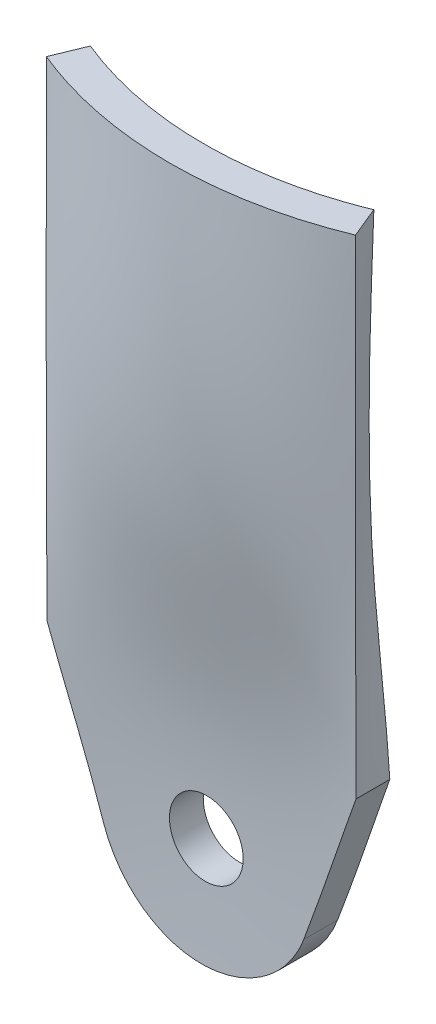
ISO-10303-21;
HEADER;
FILE_DESCRIPTION(('STEP AP214'),'2;1');
FILE_NAME('part.step','',(''),(''),'','','');
FILE_SCHEMA(('AUTOMOTIVE_DESIGN { 1 0 10303 214 1 1 1 1 }'));
ENDSEC;
DATA;
#1=APPLICATION_CONTEXT('core data for automotive mechanical design processes');
#2=APPLICATION_PROTOCOL_DEFINITION('international standard','automotive_design',2000,#1);
#3=PRODUCT_CONTEXT('',#1,'mechanical');
#4=PRODUCT('Part','Part','',(#3));
#5=PRODUCT_RELATED_PRODUCT_CATEGORY('part','',(#4));
#6=PRODUCT_DEFINITION_FORMATION('','',#4);
#7=PRODUCT_DEFINITION_CONTEXT('part definition',#1,'design');
#8=PRODUCT_DEFINITION('design','',#6,#7);
#9=PRODUCT_DEFINITION_SHAPE('','',#8);
#10=(LENGTH_UNIT() NAMED_UNIT(*) SI_UNIT(.MILLI.,.METRE.));
#11=(NAMED_UNIT(*) PLANE_ANGLE_UNIT() SI_UNIT($,.RADIAN.));
#12=(NAMED_UNIT(*) SI_UNIT($,.STERADIAN.) SOLID_ANGLE_UNIT());
#13=UNCERTAINTY_MEASURE_WITH_UNIT(LENGTH_MEASURE(1.E-05),#10,'distance_accuracy_value','');
#14=(GEOMETRIC_REPRESENTATION_CONTEXT(3) GLOBAL_UNCERTAINTY_ASSIGNED_CONTEXT((#13)) GLOBAL_UNIT_ASSIGNED_CONTEXT((#10,
#11,#12)) REPRESENTATION_CONTEXT('',''));
#15=CARTESIAN_POINT('',(0.,0.,0.));
#16=DIRECTION('',(0.,0.,1.));
#17=DIRECTION('',(1.,0.,0.));
#18=AXIS2_PLACEMENT_3D('',#15,#16,#17);
#19=CARTESIAN_POINT('',(27.6985551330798,57.15,6.14951913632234));
#20=CARTESIAN_POINT('',(27.6985551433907,38.0599496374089,6.17635597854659));
#21=CARTESIAN_POINT('',(27.6985551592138,8.76415420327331,6.2175400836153));
#22=CARTESIAN_POINT('',(27.6985550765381,-33.2999360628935,6.00235334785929));
#23=CARTESIAN_POINT('',(27.6985550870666,-56.6760590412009,6.0297565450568));
#24=CARTESIAN_POINT('',(27.698555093,-69.85,6.0452));
#25=CARTESIAN_POINT('',(9.95387424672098,57.15,13.4444482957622));
#26=CARTESIAN_POINT('',(10.1393624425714,38.0599496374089,15.3479577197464));
#27=CARTESIAN_POINT('',(10.4240146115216,8.76415420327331,18.2691036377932));
#28=CARTESIAN_POINT('',(8.93670850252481,-33.2999360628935,3.00613134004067));
#29=CARTESIAN_POINT('',(9.12611117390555,-56.6760590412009,4.94981173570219));
#30=CARTESIAN_POINT('',(9.23285169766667,-69.85,6.0452));
#31=CARTESIAN_POINT('',(-9.95387424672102,57.15,13.4444482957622));
#32=CARTESIAN_POINT('',(-10.1393624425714,38.0599496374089,15.3479577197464));
#33=CARTESIAN_POINT('',(-10.4240146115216,8.76415420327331,18.2691036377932));
#34=CARTESIAN_POINT('',(-8.93670850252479,-33.2999360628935,3.00613134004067));
#35=CARTESIAN_POINT('',(-9.12611117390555,-56.6760590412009,4.94981173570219));
#36=CARTESIAN_POINT('',(-9.23285169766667,-69.85,6.0452));
#37=CARTESIAN_POINT('',(-27.6985551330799,57.15,6.14951913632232));
#38=CARTESIAN_POINT('',(-27.6985551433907,38.0599496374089,6.17635597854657));
#39=CARTESIAN_POINT('',(-27.6985551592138,8.76415420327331,6.21754008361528));
#40=CARTESIAN_POINT('',(-27.6985550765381,-33.2999360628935,6.0023533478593));
#41=CARTESIAN_POINT('',(-27.6985550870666,-56.6760590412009,6.0297565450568));
#42=CARTESIAN_POINT('',(-27.698555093,-69.85,6.0452));
#43=B_SPLINE_SURFACE_WITH_KNOTS('',3,3,((#19,#20,#21,#22,#23,#24),(#25,#26,#27,#28,#29,#30),
(#31,#32,#33,#34,#35,#36),(#37,#38,#39,#40,#41,#42)),.UNSPECIFIED.,.F.,.F.,.F.,(4,4),(4,1,1,4),
(0.,1.),(0.,0.449449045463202,0.689729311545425,1.),.UNSPECIFIED.);
#44=CARTESIAN_POINT('',(-6.604,-50.8,5.18022822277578));
#45=CARTESIAN_POINT('',(-6.60400134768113,-50.6144778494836,5.17690730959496));
#46=CARTESIAN_POINT('',(-6.59617916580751,-50.4289759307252,5.17368909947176));
#47=CARTESIAN_POINT('',(-6.56494411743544,-50.0592246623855,5.16748264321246));
#48=CARTESIAN_POINT('',(-6.54152716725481,-49.8749756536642,5.1644944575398));
#49=CARTESIAN_POINT('',(-6.47923456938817,-49.5089404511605,5.15876929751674));
#50=CARTESIAN_POINT('',(-6.44034522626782,-49.3271565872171,5.15603254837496));
#51=CARTESIAN_POINT('',(-6.34736719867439,-48.9674425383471,5.15083020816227));
#52=CARTESIAN_POINT('',(-6.29327296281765,-48.7895137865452,5.14836471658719));
#53=CARTESIAN_POINT('',(-6.17032669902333,-48.4389936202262,5.14372067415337));
#54=CARTESIAN_POINT('',(-6.10148702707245,-48.2663978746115,5.14154188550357));
#55=CARTESIAN_POINT('',(-5.94948384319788,-47.9275531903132,5.13747465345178));
#56=CARTESIAN_POINT('',(-5.86631505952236,-47.7613066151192,5.13558631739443));
#57=CARTESIAN_POINT('',(-5.6863179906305,-47.4365114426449,5.13210191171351));
#58=CARTESIAN_POINT('',(-5.58949816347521,-47.2779581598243,5.13050566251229));
#59=CARTESIAN_POINT('',(-5.38280977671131,-46.9695101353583,5.12759619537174));
#60=CARTESIAN_POINT('',(-5.27293641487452,-46.8196186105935,5.12628308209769));
#61=CARTESIAN_POINT('',(-5.04099694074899,-46.5296818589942,5.1239265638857));
#62=CARTESIAN_POINT('',(-4.91893569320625,-46.3896327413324,5.12288305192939));
#63=CARTESIAN_POINT('',(-4.66340405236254,-46.1202611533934,5.1210432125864));
#64=CARTESIAN_POINT('',(-4.52992946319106,-45.9909426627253,5.12024697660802));
#65=CARTESIAN_POINT('',(-4.25260502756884,-45.7440509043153,5.11887468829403));
#66=CARTESIAN_POINT('',(-4.10875861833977,-45.6264737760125,5.11829856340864));
#67=CARTESIAN_POINT('',(-3.81161897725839,-45.4038108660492,5.11733324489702));
#68=CARTESIAN_POINT('',(-3.65832227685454,-45.2987297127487,5.1169441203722));
#69=CARTESIAN_POINT('',(-3.34348273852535,-45.1018957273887,5.11631721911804));
#70=CARTESIAN_POINT('',(-3.18194319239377,-45.0101376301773,5.11607938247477));
#71=CARTESIAN_POINT('',(-2.85164925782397,-44.8405208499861,5.11571754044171));
#72=CARTESIAN_POINT('',(-2.68289222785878,-44.7626673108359,5.11559357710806));
#73=CARTESIAN_POINT('',(-2.33948172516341,-44.6214813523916,5.11542346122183));
#74=CARTESIAN_POINT('',(-2.16483046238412,-44.5581435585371,5.11537727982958));
#75=CARTESIAN_POINT('',(-1.81075234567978,-44.4463808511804,5.11532990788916));
#76=CARTESIAN_POINT('',(-1.63132375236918,-44.3979614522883,5.11532873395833));
#77=CARTESIAN_POINT('',(-1.26906579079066,-44.3164262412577,5.11534406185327));
#78=CARTESIAN_POINT('',(-1.08623745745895,-44.2833058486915,5.11536055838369));
#79=CARTESIAN_POINT('',(-0.718424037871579,-44.2325640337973,5.11539208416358));
#80=CARTESIAN_POINT('',(-0.533438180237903,-44.2149483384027,5.11540711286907));
#81=CARTESIAN_POINT('',(0.0226468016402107,-44.185641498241,5.11543048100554));
#82=CARTESIAN_POINT('',(0.395267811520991,-44.1974021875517,5.1154171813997));
#83=CARTESIAN_POINT('',(1.13304842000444,-44.2833175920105,5.11535847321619));
#84=CARTESIAN_POINT('',(1.49820791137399,-44.3574732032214,5.11531306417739));
#85=CARTESIAN_POINT('',(2.21094937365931,-44.56603610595,5.11536665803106));
#86=CARTESIAN_POINT('',(2.55853132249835,-44.7004434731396,5.1154656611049));
#87=CARTESIAN_POINT('',(3.22618100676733,-45.0257042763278,5.11608086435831));
#88=CARTESIAN_POINT('',(3.54624881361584,-45.2165575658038,5.11659706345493));
#89=CARTESIAN_POINT('',(4.14980257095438,-45.6492886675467,5.11834608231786));
#90=CARTESIAN_POINT('',(4.43328855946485,-45.8911664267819,5.11957890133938));
#91=CARTESIAN_POINT('',(4.95561220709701,-46.419064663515,5.1230156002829));
#92=CARTESIAN_POINT('',(5.19445216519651,-46.7050828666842,5.12521943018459));
#93=CARTESIAN_POINT('',(5.6207239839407,-47.3131476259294,5.13075731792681));
#94=CARTESIAN_POINT('',(5.80815585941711,-47.6351941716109,5.13409137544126));
#95=CARTESIAN_POINT('',(6.12628702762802,-48.3061543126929,5.14193292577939));
#96=CARTESIAN_POINT('',(6.25698883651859,-48.6550667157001,5.14644036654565));
#97=CARTESIAN_POINT('',(6.45796890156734,-49.3698649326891,5.15656282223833));
#98=CARTESIAN_POINT('',(6.52824712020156,-49.7357507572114,5.16217783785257));
#99=CARTESIAN_POINT('',(6.60639831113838,-50.4741580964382,5.17436215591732));
#100=CARTESIAN_POINT('',(6.61426344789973,-50.8466804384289,5.18093157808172));
#101=CARTESIAN_POINT('',(6.56735240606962,-51.5877459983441,5.19480387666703));
#102=CARTESIAN_POINT('',(6.51257614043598,-51.9562892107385,5.20210675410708));
#103=CARTESIAN_POINT('',(6.34192100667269,-52.6790307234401,5.21717507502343));
#104=CARTESIAN_POINT('',(6.22602736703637,-53.0332255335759,5.22494062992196));
#105=CARTESIAN_POINT('',(5.93642012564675,-53.7171273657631,5.24061236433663));
#106=CARTESIAN_POINT('',(5.76270645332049,-54.046834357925,5.24851854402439));
#107=CARTESIAN_POINT('',(5.36235272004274,-54.6724579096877,5.26410767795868));
#108=CARTESIAN_POINT('',(5.13570405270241,-54.9683689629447,5.27179059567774));
#109=CARTESIAN_POINT('',(4.63592895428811,-55.5179380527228,5.28653114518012));
#110=CARTESIAN_POINT('',(4.36280250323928,-55.7715960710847,5.29358877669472));
#111=CARTESIAN_POINT('',(3.77782659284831,-56.2294337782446,5.30666465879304));
#112=CARTESIAN_POINT('',(3.46598054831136,-56.4336178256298,5.31268300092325));
#113=CARTESIAN_POINT('',(2.8124650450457,-56.7867257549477,5.32329153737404));
#114=CARTESIAN_POINT('',(2.47079568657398,-56.935649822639,5.32788173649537));
#115=CARTESIAN_POINT('',(1.76721249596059,-57.1739685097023,5.33531152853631));
#116=CARTESIAN_POINT('',(1.40530641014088,-57.2633857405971,5.33815178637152));
#117=CARTESIAN_POINT('',(0.855406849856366,-57.3510104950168,5.340946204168));
#118=CARTESIAN_POINT('',(0.670832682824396,-57.3724675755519,5.3416333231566));
#119=CARTESIAN_POINT('',(0.300550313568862,-57.3997637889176,5.3425081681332));
#120=CARTESIAN_POINT('',(0.114842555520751,-57.4056086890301,5.34269607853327));
#121=CARTESIAN_POINT('',(-0.256386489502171,-57.4016328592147,5.34256848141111));
#122=CARTESIAN_POINT('',(-0.441907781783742,-57.3918125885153,5.34225298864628));
#123=CARTESIAN_POINT('',(-0.811397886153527,-57.3565899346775,5.34112505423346));
#124=CARTESIAN_POINT('',(-0.99536724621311,-57.3311933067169,5.34031279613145));
#125=CARTESIAN_POINT('',(-1.36057886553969,-57.264990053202,5.33820625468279));
#126=CARTESIAN_POINT('',(-1.54182008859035,-57.2241777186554,5.33691179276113));
#127=CARTESIAN_POINT('',(-1.90015193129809,-57.1274532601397,5.33386540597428));
#128=CARTESIAN_POINT('',(-2.07724405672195,-57.0715467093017,5.33211364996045));
#129=CARTESIAN_POINT('',(-2.42615622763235,-56.9450007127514,5.32818340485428));
#130=CARTESIAN_POINT('',(-2.59797421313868,-56.8743555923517,5.32600475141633));
#131=CARTESIAN_POINT('',(-2.93498369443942,-56.7188775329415,5.32126043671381));
#132=CARTESIAN_POINT('',(-3.10017760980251,-56.6340498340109,5.31869491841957));
#133=CARTESIAN_POINT('',(-3.42288723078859,-56.4507614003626,5.31321908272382));
#134=CARTESIAN_POINT('',(-3.5804003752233,-56.3522961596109,5.31030865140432));
#135=CARTESIAN_POINT('',(-3.88651519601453,-56.1424932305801,5.30419247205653));
#136=CARTESIAN_POINT('',(-4.03512013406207,-56.0311602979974,5.30098683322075));
#137=CARTESIAN_POINT('',(-4.32252254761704,-55.7963062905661,5.29432725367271));
#138=CARTESIAN_POINT('',(-4.46131350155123,-55.6727772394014,5.29087315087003));
#139=CARTESIAN_POINT('',(-4.72794576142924,-55.4145183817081,5.28377120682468));
#140=CARTESIAN_POINT('',(-4.85579108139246,-55.2797927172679,5.28012343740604));
#141=CARTESIAN_POINT('',(-5.0997581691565,-54.999971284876,5.27268198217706));
#142=CARTESIAN_POINT('',(-5.21587263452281,-54.854869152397,5.26888820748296));
#143=CARTESIAN_POINT('',(-5.43542278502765,-54.5554554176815,5.26120865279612));
#144=CARTESIAN_POINT('',(-5.53886312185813,-54.4011472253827,5.25732290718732));
#145=CARTESIAN_POINT('',(-5.73249950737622,-54.0841740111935,5.24950178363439));
#146=CARTESIAN_POINT('',(-5.82267916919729,-53.9214989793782,5.24556635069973));
#147=CARTESIAN_POINT('',(-5.9889704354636,-53.5891860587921,5.23769836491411));
#148=CARTESIAN_POINT('',(-6.06508716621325,-53.4195507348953,5.23376581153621));
#149=CARTESIAN_POINT('',(-6.20269110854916,-53.0746172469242,5.22594920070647));
#150=CARTESIAN_POINT('',(-6.26419124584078,-52.8993242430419,5.22206510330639));
#151=CARTESIAN_POINT('',(-6.37219627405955,-52.5442384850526,5.21438384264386));
#152=CARTESIAN_POINT('',(-6.41870509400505,-52.3644469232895,5.21058665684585));
#153=CARTESIAN_POINT('',(-6.50618800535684,-51.9559514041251,5.20217632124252));
#154=CARTESIAN_POINT('',(-6.5428358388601,-51.726307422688,5.19759785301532));
#155=CARTESIAN_POINT('',(-6.59174099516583,-51.2644317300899,5.18870203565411));
#156=CARTESIAN_POINT('',(-6.6039983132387,-51.0322000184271,5.18438468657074));
#157=CARTESIAN_POINT('',(-6.604,-50.8,5.18022822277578));
#158=B_SPLINE_CURVE_WITH_KNOTS('',3,(#44,#45,#46,#47,#48,#49,#50,#51,#52,#53,#54,#55,#56,#57,
#58,#59,#60,#61,#62,#63,#64,#65,#66,#67,#68,#69,#70,#71,#72,#73,#74,#75,#76,#77,#78,#79,#80,#81,
#82,#83,#84,#85,#86,#87,#88,#89,#90,#91,#92,#93,#94,#95,#96,#97,#98,#99,#100,#101,#102,#103,
#104,#105,#106,#107,#108,#109,#110,#111,#112,#113,#114,#115,#116,#117,#118,#119,#120,#121,#122,
#123,#124,#125,#126,#127,#128,#129,#130,#131,#132,#133,#134,#135,#136,#137,#138,#139,#140,#141,
#142,#143,#144,#145,#146,#147,#148,#149,#150,#151,#152,#153,#154,#155,#156,#157),.UNSPECIFIED.,
.T.,.F.,(4,2,2,2,2,2,2,2,2,2,2,2,2,2,2,2,2,2,2,2,2,2,2,2,2,2,2,2,2,2,2,2,2,2,2,2,2,2,2,2,2,2,2,
2,2,2,2,2,2,2,2,2,2,2,2,2,4),(0.,0.556452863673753,1.11305149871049,1.67014390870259,
2.22743998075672,2.78427087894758,3.34130707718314,3.89799964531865,4.45489765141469,
5.01157425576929,5.56845639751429,6.12515482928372,6.68205881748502,7.23874211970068,
7.7956309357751,8.35231322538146,8.90920104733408,9.46592203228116,10.0228485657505,
11.1355041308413,12.2481756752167,13.360848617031,14.4735186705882,15.5861875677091,
16.6987991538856,17.8114104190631,18.9239723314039,20.0365349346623,21.1492372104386,
22.2619410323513,23.3749139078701,24.4878881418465,25.6010434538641,26.7141992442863,
27.8272569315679,28.9403108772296,30.0529416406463,30.6098548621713,31.1665623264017,
31.7232534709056,32.2797390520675,32.836430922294,33.3929175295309,33.9496187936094,
34.5061148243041,35.0627951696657,35.6192704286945,36.1761120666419,36.7327486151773,
37.2897295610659,37.8465054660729,38.4039637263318,38.961218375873,39.5179783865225,
40.0745923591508,40.7710501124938,41.4675080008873),.UNSPECIFIED.);
#159=CARTESIAN_POINT('',(-6.604,-50.8,5.18022822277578));
#160=VERTEX_POINT('',#159);
#161=EDGE_CURVE('E485',#160,#160,#158,.T.);
#162=CARTESIAN_POINT('',(-27.6985551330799,57.15,6.14951913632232));
#163=CARTESIAN_POINT('',(-27.6985551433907,38.0599496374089,6.17635597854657));
#164=CARTESIAN_POINT('',(-27.6985551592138,8.76415420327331,6.21754008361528));
#165=CARTESIAN_POINT('',(-27.6985550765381,-33.2999360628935,6.0023533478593));
#166=CARTESIAN_POINT('',(-27.6985550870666,-56.6760590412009,6.0297565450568));
#167=CARTESIAN_POINT('',(-27.698555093,-69.85,6.0452));
#168=B_SPLINE_CURVE_WITH_KNOTS('',3,(#162,#163,#164,#165,#166,#167),.UNSPECIFIED.,.F.,.F.,(4,1,
1,4),(0.,0.449449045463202,0.689729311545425,1.),.UNSPECIFIED.);
#169=CARTESIAN_POINT('',(-27.6985551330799,57.15,6.14951913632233));
#170=VERTEX_POINT('',#169);
#171=CARTESIAN_POINT('',(-27.698555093,-30.397318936,6.0452));
#172=VERTEX_POINT('',#171);
#173=EDGE_CURVE('E484',#170,#172,#168,.T.);
#174=CARTESIAN_POINT('',(-27.6985550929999,-30.3973190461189,6.04519999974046));
#175=CARTESIAN_POINT('',(-27.535221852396,-30.8460734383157,6.04413267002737));
#176=CARTESIAN_POINT('',(-27.3718917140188,-31.2948193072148,6.04117638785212));
#177=CARTESIAN_POINT('',(-27.0452442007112,-32.1922759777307,6.03213643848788));
#178=CARTESIAN_POINT('',(-26.8819268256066,-32.6409867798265,6.02605282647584));
#179=CARTESIAN_POINT('',(-26.555320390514,-33.5383305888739,6.01140931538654));
#180=CARTESIAN_POINT('',(-26.392031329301,-33.9869635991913,6.00284964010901));
#181=CARTESIAN_POINT('',(-26.0654655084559,-34.8841958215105,5.98383468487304));
#182=CARTESIAN_POINT('',(-25.9021887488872,-35.332795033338,5.97337939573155));
#183=CARTESIAN_POINT('',(-25.4123807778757,-36.6785313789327,5.93999227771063));
#184=CARTESIAN_POINT('',(-25.0858660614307,-37.575623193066,5.91503889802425));
#185=CARTESIAN_POINT('',(-24.4328561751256,-39.3697531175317,5.86351087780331));
#186=CARTESIAN_POINT('',(-24.1063610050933,-40.2667912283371,5.83693625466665));
#187=CARTESIAN_POINT('',(-23.4533653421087,-42.0608820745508,5.78523896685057));
#188=CARTESIAN_POINT('',(-23.1268648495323,-42.9579348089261,5.76011626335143));
#189=CARTESIAN_POINT('',(-22.4737998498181,-44.7522161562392,5.71378544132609));
#190=CARTESIAN_POINT('',(-22.1472353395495,-45.6494447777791,5.69257768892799));
#191=CARTESIAN_POINT('',(-21.494082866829,-47.4439664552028,5.65597676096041));
#192=CARTESIAN_POINT('',(-21.1674949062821,-48.3412595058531,5.64058330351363));
#193=CARTESIAN_POINT('',(-20.5142926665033,-50.1359179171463,5.61697511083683));
#194=CARTESIAN_POINT('',(-20.1876783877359,-51.0332832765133,5.60876026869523));
#195=CARTESIAN_POINT('',(-19.5344214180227,-52.8280920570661,5.60038058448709));
#196=CARTESIAN_POINT('',(-19.2077787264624,-53.7255354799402,5.60021611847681));
#197=CARTESIAN_POINT('',(-18.7178046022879,-55.0717283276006,5.60630702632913));
#198=CARTESIAN_POINT('',(-18.5544679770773,-55.5204920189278,5.60939398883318));
#199=CARTESIAN_POINT('',(-18.2278008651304,-56.418002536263,5.61768185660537));
#200=CARTESIAN_POINT('',(-18.0644703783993,-56.8667493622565,5.62288276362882));
#201=CARTESIAN_POINT('',(-17.9011444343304,-57.3154837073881,5.62914112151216));
#202=B_SPLINE_CURVE_WITH_KNOTS('',3,(#174,#175,#176,#177,#178,#179,#180,#181,#182,#183,#184,
#185,#186,#187,#188,#189,#190,#191,#192,#193,#194,#195,#196,#197,#198,#199,#200,#201),
.UNSPECIFIED.,.F.,.F.,(4,2,2,2,2,2,2,2,2,2,2,2,2,4),(0.,1.43265623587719,2.86528719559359,
4.29778870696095,5.73029715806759,8.59526306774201,11.4601982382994,14.325056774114,
17.1901830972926,20.0551705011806,22.9201152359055,25.7851938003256,27.2179126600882,
28.6506327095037),.UNSPECIFIED.);
#203=CARTESIAN_POINT('',(-17.9011444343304,-57.3154837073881,5.62914112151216));
#204=VERTEX_POINT('',#203);
#205=EDGE_CURVE('E421',#172,#204,#202,.T.);
#206=CARTESIAN_POINT('',(-17.9011444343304,-57.3154837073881,5.62914112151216));
#207=CARTESIAN_POINT('',(-17.7789793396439,-57.65116290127,5.63381747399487));
#208=CARTESIAN_POINT('',(-17.6473528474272,-57.9833943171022,5.63869282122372));
#209=CARTESIAN_POINT('',(-17.3656478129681,-58.6399137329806,5.64889722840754));
#210=CARTESIAN_POINT('',(-17.2155701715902,-58.9642021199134,5.65422626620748));
#211=CARTESIAN_POINT('',(-16.8974242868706,-59.6038151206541,5.66539412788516));
#212=CARTESIAN_POINT('',(-16.7293563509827,-59.9191398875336,5.6712329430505));
#213=CARTESIAN_POINT('',(-16.3758949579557,-60.5396070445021,5.68344699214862));
#214=CARTESIAN_POINT('',(-16.1905142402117,-60.8447567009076,5.68982183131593));
#215=CARTESIAN_POINT('',(-15.8029076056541,-61.4441523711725,5.70311954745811));
#216=CARTESIAN_POINT('',(-15.6006818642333,-61.7383984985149,5.71004241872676));
#217=CARTESIAN_POINT('',(-15.1800422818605,-62.3150426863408,5.72441587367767));
#218=CARTESIAN_POINT('',(-14.9616285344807,-62.5974408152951,5.73186645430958));
#219=CARTESIAN_POINT('',(-14.3960641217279,-63.287692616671,5.75110203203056));
#220=CARTESIAN_POINT('',(-14.0391794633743,-63.6876202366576,5.76319051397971));
#221=CARTESIAN_POINT('',(-13.2929325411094,-64.4560353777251,5.78819260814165));
#222=CARTESIAN_POINT('',(-12.9035659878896,-64.8245187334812,5.80110632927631));
#223=CARTESIAN_POINT('',(-12.2974029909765,-65.3515679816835,5.82079751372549));
#224=CARTESIAN_POINT('',(-12.0916502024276,-65.5229812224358,5.82741507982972));
#225=CARTESIAN_POINT('',(-11.6731653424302,-65.856937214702,5.84069807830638));
#226=CARTESIAN_POINT('',(-11.4604352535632,-66.019482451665,5.84736349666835));
#227=CARTESIAN_POINT('',(-10.8122044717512,-66.493476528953,5.8673448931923));
#228=CARTESIAN_POINT('',(-10.3666286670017,-66.7913138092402,5.88064715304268));
#229=CARTESIAN_POINT('',(-9.45182459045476,-67.3484912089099,5.90668683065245));
#230=CARTESIAN_POINT('',(-8.98258621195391,-67.6078146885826,5.91942400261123));
#231=CARTESIAN_POINT('',(-8.02388812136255,-68.0860239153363,5.94378880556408));
#232=CARTESIAN_POINT('',(-7.53442836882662,-68.3049095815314,5.95541643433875));
#233=CARTESIAN_POINT('',(-6.53870834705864,-68.7006948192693,5.97704875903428));
#234=CARTESIAN_POINT('',(-6.03244573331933,-68.8775885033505,5.98705322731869));
#235=CARTESIAN_POINT('',(-5.00677822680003,-69.1880876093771,6.00498310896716));
#236=CARTESIAN_POINT('',(-4.48737335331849,-69.3216930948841,6.01290852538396));
#237=CARTESIAN_POINT('',(-3.43951311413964,-69.5445714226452,6.02630991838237));
#238=CARTESIAN_POINT('',(-2.91106481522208,-69.6338773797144,6.03178772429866));
#239=CARTESIAN_POINT('',(-1.84850286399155,-69.767663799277,6.04004831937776));
#240=CARTESIAN_POINT('',(-1.31438921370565,-69.8121442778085,6.04283110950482));
#241=CARTESIAN_POINT('',(-0.244340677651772,-69.855957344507,6.04557187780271));
#242=CARTESIAN_POINT('',(0.291594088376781,-69.8552928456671,6.04553003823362));
#243=CARTESIAN_POINT('',(1.36149526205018,-69.8088279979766,6.0426239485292));
#244=CARTESIAN_POINT('',(1.89546167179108,-69.7630276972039,6.03975970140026));
#245=CARTESIAN_POINT('',(2.95678369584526,-69.6267290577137,6.03134891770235));
#246=CARTESIAN_POINT('',(3.4841483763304,-69.5363010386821,6.02580660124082));
#247=CARTESIAN_POINT('',(4.52937601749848,-69.3114294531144,6.0122979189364));
#248=CARTESIAN_POINT('',(5.04723898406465,-69.1769859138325,6.0043315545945));
#249=CARTESIAN_POINT('',(6.06977613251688,-68.8650499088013,5.98634046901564));
#250=CARTESIAN_POINT('',(6.57445077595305,-68.687558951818,5.97631581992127));
#251=CARTESIAN_POINT('',(7.56705984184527,-68.2907914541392,5.95466079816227));
#252=CARTESIAN_POINT('',(8.05499427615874,-68.0715149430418,5.94303042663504));
#253=CARTESIAN_POINT('',(9.01108982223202,-67.5925243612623,5.91866531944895));
#254=CARTESIAN_POINT('',(9.47923378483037,-67.3327760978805,5.90592965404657));
#255=CARTESIAN_POINT('',(10.391987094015,-66.7748319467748,5.87990091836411));
#256=CARTESIAN_POINT('',(10.8365962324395,-66.4766357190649,5.86660784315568));
#257=CARTESIAN_POINT('',(11.6993689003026,-65.8437203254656,5.83998281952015));
#258=CARTESIAN_POINT('',(12.1175219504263,-65.5089868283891,5.82665085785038));
#259=CARTESIAN_POINT('',(12.7223863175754,-64.981502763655,5.80698657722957));
#260=CARTESIAN_POINT('',(12.9202857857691,-64.8014383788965,5.80048723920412));
#261=CARTESIAN_POINT('',(13.3083824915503,-64.4330864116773,5.78764625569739));
#262=CARTESIAN_POINT('',(13.4985777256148,-64.2447967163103,5.78130465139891));
#263=CARTESIAN_POINT('',(14.0577110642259,-63.6674240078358,5.76256538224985));
#264=CARTESIAN_POINT('',(14.41450256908,-63.2664428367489,5.75047607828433));
#265=CARTESIAN_POINT('',(15.0929923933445,-62.4357923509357,5.72739740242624));
#266=CARTESIAN_POINT('',(15.4146910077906,-62.0061232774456,5.71640802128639));
#267=CARTESIAN_POINT('',(15.8689425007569,-61.3428130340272,5.70085407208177));
#268=CARTESIAN_POINT('',(16.0155659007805,-61.1187120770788,5.69582711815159));
#269=CARTESIAN_POINT('',(16.2992062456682,-60.6645855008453,5.68608175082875));
#270=CARTESIAN_POINT('',(16.4362253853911,-60.434561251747,5.68136326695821));
#271=CARTESIAN_POINT('',(16.83244308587,-59.7363029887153,5.66766843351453));
#272=CARTESIAN_POINT('',(17.0769995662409,-59.2595947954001,5.65914596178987));
#273=CARTESIAN_POINT('',(17.4110830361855,-58.5347249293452,5.64725134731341));
#274=CARTESIAN_POINT('',(17.5162082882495,-58.2936073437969,5.64346388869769));
#275=CARTESIAN_POINT('',(17.716243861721,-57.8075759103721,5.6361316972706));
#276=CARTESIAN_POINT('',(17.8111687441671,-57.5626680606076,5.63258662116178));
#277=CARTESIAN_POINT('',(17.901007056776,-57.3158611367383,5.62914638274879));
#278=B_SPLINE_CURVE_WITH_KNOTS('',3,(#206,#207,#208,#209,#210,#211,#212,#213,#214,#215,#216,
#217,#218,#219,#220,#221,#222,#223,#224,#225,#226,#227,#228,#229,#230,#231,#232,#233,#234,#235,
#236,#237,#238,#239,#240,#241,#242,#243,#244,#245,#246,#247,#248,#249,#250,#251,#252,#253,#254,
#255,#256,#257,#258,#259,#260,#261,#262,#263,#264,#265,#266,#267,#268,#269,#270,#271,#272,#273,
#274,#275,#276,#277),.UNSPECIFIED.,.F.,.F.,(4,2,2,2,2,2,2,2,2,2,2,2,2,2,2,2,2,2,2,2,2,2,2,2,2,2,
2,2,2,2,2,2,2,2,2,4),(0.,1.07160285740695,2.14315341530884,3.21468566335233,4.28543555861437,
5.35617430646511,6.42690686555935,8.03337587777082,9.64005736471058,10.4434939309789,
11.2467041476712,12.852987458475,14.4599627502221,16.0669412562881,17.6741449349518,
19.281346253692,20.8873443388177,22.4933418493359,24.0992357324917,25.70512790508,
27.3084977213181,28.9118665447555,30.515179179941,32.1184906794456,33.7231641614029,
35.3278518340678,36.93317119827,37.7358785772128,38.538793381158,40.1473783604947,
41.7559498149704,42.5592940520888,43.3624540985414,44.9677276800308,45.7567416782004,
46.5446139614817),.UNSPECIFIED.);
#279=CARTESIAN_POINT('',(17.901007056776,-57.3158611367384,5.62914638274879));
#280=VERTEX_POINT('',#279);
#281=EDGE_CURVE('E605',#204,#280,#278,.T.);
#282=CARTESIAN_POINT('',(17.901007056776,-57.3158611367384,5.62914638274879));
#283=CARTESIAN_POINT('',(18.0643352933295,-56.8671499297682,5.62288810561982));
#284=CARTESIAN_POINT('',(18.2276680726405,-56.4184262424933,5.61768720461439));
#285=CARTESIAN_POINT('',(18.554339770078,-55.5209620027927,5.60939920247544));
#286=CARTESIAN_POINT('',(18.7176786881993,-55.0722214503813,5.6063120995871));
#287=CARTESIAN_POINT('',(19.207659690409,-53.7260980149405,5.60022055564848));
#288=CARTESIAN_POINT('',(19.5343069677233,-52.8287008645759,5.6003843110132));
#289=CARTESIAN_POINT('',(20.1875731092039,-51.0339846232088,5.60876207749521));
#290=CARTESIAN_POINT('',(20.5141919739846,-50.1366655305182,5.61697571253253));
#291=CARTESIAN_POINT('',(21.1674033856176,-48.3420996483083,5.6405811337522));
#292=CARTESIAN_POINT('',(21.4939959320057,-47.4448528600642,5.65597302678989));
#293=CARTESIAN_POINT('',(22.1471575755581,-45.6504237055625,5.69257067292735));
#294=CARTESIAN_POINT('',(22.4737266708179,-44.7532413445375,5.71377670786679));
#295=CARTESIAN_POINT('',(23.1268008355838,-42.959052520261,5.76010421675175));
#296=CARTESIAN_POINT('',(23.4533059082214,-42.0620460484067,5.7852253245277));
#297=CARTESIAN_POINT('',(24.1063107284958,-40.2680477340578,5.83691989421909));
#298=CARTESIAN_POINT('',(24.4328104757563,-39.3710558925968,5.86349339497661));
#299=CARTESIAN_POINT('',(25.0858295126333,-37.5770185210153,5.91502007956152));
#300=CARTESIAN_POINT('',(25.412348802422,-36.6799729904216,5.93997324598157));
#301=CARTESIAN_POINT('',(25.9021636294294,-35.3343060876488,5.97336112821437));
#302=CARTESIAN_POINT('',(26.0654426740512,-34.885730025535,5.98381685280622));
#303=CARTESIAN_POINT('',(26.3920130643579,-33.9885441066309,6.00283311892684));
#304=CARTESIAN_POINT('',(26.5553044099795,-33.5399342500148,6.01139366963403));
#305=CARTESIAN_POINT('',(26.88191541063,-32.6426367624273,6.02603945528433));
#306=CARTESIAN_POINT('',(27.0452350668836,-32.193949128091,6.03212446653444));
#307=CARTESIAN_POINT('',(27.3718871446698,-31.2965387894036,6.04116783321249));
#308=CARTESIAN_POINT('',(27.5352195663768,-30.8478160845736,6.04412613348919));
#309=CARTESIAN_POINT('',(27.6985550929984,-30.3990848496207,6.04519583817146));
#310=B_SPLINE_CURVE_WITH_KNOTS('',3,(#282,#283,#284,#285,#286,#287,#288,#289,#290,#291,#292,
#293,#294,#295,#296,#297,#298,#299,#300,#301,#302,#303,#304,#305,#306,#307,#308,#309),
.UNSPECIFIED.,.F.,.F.,(4,2,2,2,2,2,2,2,2,2,2,2,2,4),(0.,1.43265717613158,2.86531316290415,
5.73026599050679,8.59508497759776,11.4599466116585,14.3249471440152,17.1896798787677,
20.054489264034,22.9193294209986,24.3517750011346,25.7842136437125,27.2167816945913,
28.6493750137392),.UNSPECIFIED.);
#311=CARTESIAN_POINT('',(27.6985550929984,-30.3990848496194,6.04519583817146));
#312=VERTEX_POINT('',#311);
#313=EDGE_CURVE('E603',#280,#312,#310,.T.);
#314=CARTESIAN_POINT('',(27.6985551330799,57.15,6.14951913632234));
#315=CARTESIAN_POINT('',(27.6985551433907,38.0599496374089,6.17635597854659));
#316=CARTESIAN_POINT('',(27.6985551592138,8.76415420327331,6.2175400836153));
#317=CARTESIAN_POINT('',(27.6985550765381,-33.2999360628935,6.00235334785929));
#318=CARTESIAN_POINT('',(27.6985550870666,-56.6760590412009,6.0297565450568));
#319=CARTESIAN_POINT('',(27.698555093,-69.85,6.0452));
#320=B_SPLINE_CURVE_WITH_KNOTS('',3,(#314,#315,#316,#317,#318,#319),.UNSPECIFIED.,.F.,.F.,(4,1,
1,4),(0.,0.449449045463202,0.689729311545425,1.),.UNSPECIFIED.);
#321=CARTESIAN_POINT('',(27.6985551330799,57.15,6.14951913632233));
#322=VERTEX_POINT('',#321);
#323=EDGE_CURVE('E633',#322,#312,#320,.T.);
#324=CARTESIAN_POINT('',(27.6985551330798,57.15,6.14951913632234));
#325=CARTESIAN_POINT('',(9.95387424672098,57.15,13.4444482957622));
#326=CARTESIAN_POINT('',(-9.95387424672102,57.15,13.4444482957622));
#327=CARTESIAN_POINT('',(-27.6985551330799,57.15,6.14951913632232));
#328=B_SPLINE_CURVE_WITH_KNOTS('',3,(#324,#325,#326,#327),.UNSPECIFIED.,.F.,.F.,(4,4),(0.,1.),.UNSPECIFIED.);
#329=EDGE_CURVE('E653',#170,#322,#328,.F.);
#330=ORIENTED_EDGE('',*,*,#161,.T.);
#331=EDGE_LOOP('',(#330));
#332=FACE_BOUND('',#331,.T.);
#333=ORIENTED_EDGE('',*,*,#173,.T.);
#334=ORIENTED_EDGE('',*,*,#205,.T.);
#335=ORIENTED_EDGE('',*,*,#281,.T.);
#336=ORIENTED_EDGE('',*,*,#313,.T.);
#337=ORIENTED_EDGE('',*,*,#323,.F.);
#338=ORIENTED_EDGE('',*,*,#329,.F.);
#339=EDGE_LOOP('',(#333,#334,#335,#336,#337,#338));
#340=FACE_BOUND('',#339,.T.);
#341=ADVANCED_FACE('F403',(#332,#340),#43,.T.);
#342=CARTESIAN_POINT('',(-25.4,57.15,0.558357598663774));
#343=CARTESIAN_POINT('',(-24.8086803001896,38.0599496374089,0.701999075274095));
#344=CARTESIAN_POINT('',(-23.9012347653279,8.76415420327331,0.922432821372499));
#345=CARTESIAN_POINT('',(-28.6426329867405,-33.2999360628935,-0.229332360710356));
#346=CARTESIAN_POINT('',(-28.0388342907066,-56.6760590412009,-0.082659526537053));
#347=CARTESIAN_POINT('',(-27.698555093,-69.85,0.));
#348=CARTESIAN_POINT('',(-9.12785539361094,57.15,7.24791955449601));
#349=CARTESIAN_POINT('',(-9.10084434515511,38.0599496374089,9.11249857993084));
#350=CARTESIAN_POINT('',(-9.05939290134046,8.76415420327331,11.9739014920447));
#351=CARTESIAN_POINT('',(-9.27597648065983,-33.2999360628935,-2.97691390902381));
#352=CARTESIAN_POINT('',(-9.2483954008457,-56.6760590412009,-1.07298548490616));
#353=CARTESIAN_POINT('',(-9.23285169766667,-69.85,0.));
#354=CARTESIAN_POINT('',(9.12785539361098,57.15,7.24791955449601));
#355=CARTESIAN_POINT('',(9.10084434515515,38.0599496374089,9.11249857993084));
#356=CARTESIAN_POINT('',(9.05939290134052,8.76415420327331,11.9739014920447));
#357=CARTESIAN_POINT('',(9.27597648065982,-33.2999360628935,-2.97691390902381));
#358=CARTESIAN_POINT('',(9.24839540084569,-56.6760590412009,-1.07298548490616));
#359=CARTESIAN_POINT('',(9.23285169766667,-69.85,0.));
#360=CARTESIAN_POINT('',(25.4,57.15,0.558357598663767));
#361=CARTESIAN_POINT('',(24.8086803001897,38.0599496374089,0.701999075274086));
#362=CARTESIAN_POINT('',(23.901234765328,8.76415420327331,0.922432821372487));
#363=CARTESIAN_POINT('',(28.6426329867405,-33.2999360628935,-0.229332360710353));
#364=CARTESIAN_POINT('',(28.0388342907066,-56.6760590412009,-0.082659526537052));
#365=CARTESIAN_POINT('',(27.698555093,-69.85,0.));
#366=B_SPLINE_SURFACE_WITH_KNOTS('',3,3,((#342,#343,#344,#345,#346,#347),(#348,#349,#350,#351,
#352,#353),(#354,#355,#356,#357,#358,#359),(#360,#361,#362,#363,#364,#365)),.UNSPECIFIED.,.F.,
.F.,.F.,(4,4),(4,1,1,4),(0.,1.),(0.,0.449449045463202,0.689729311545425,1.),.UNSPECIFIED.);
#367=CARTESIAN_POINT('',(-6.604,-50.8,-0.870528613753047));
#368=CARTESIAN_POINT('',(-6.60400133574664,-50.9855841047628,-0.867180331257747));
#369=CARTESIAN_POINT('',(-6.59617392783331,-51.1711441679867,-0.863715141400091));
#370=CARTESIAN_POINT('',(-6.56491998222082,-51.5410028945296,-0.85658126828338));
#371=CARTESIAN_POINT('',(-6.54148934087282,-51.7253012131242,-0.852912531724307));
#372=CARTESIAN_POINT('',(-6.47916277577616,-52.0914266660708,-0.845405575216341));
#373=CARTESIAN_POINT('',(-6.44025307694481,-52.273251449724,-0.841567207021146));
#374=CARTESIAN_POINT('',(-6.34722955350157,-52.6330383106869,-0.833762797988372));
#375=CARTESIAN_POINT('',(-6.29311017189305,-52.8109989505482,-0.829796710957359));
#376=CARTESIAN_POINT('',(-6.1701113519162,-53.1615716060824,-0.821785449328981));
#377=CARTESIAN_POINT('',(-6.10124452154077,-53.3341880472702,-0.817740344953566));
#378=CARTESIAN_POINT('',(-5.94918512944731,-53.6730671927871,-0.809613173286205));
#379=CARTESIAN_POINT('',(-5.86598729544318,-53.8393275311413,-0.805531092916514));
#380=CARTESIAN_POINT('',(-5.68593066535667,-54.1641446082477,-0.797383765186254));
#381=CARTESIAN_POINT('',(-5.58908032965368,-54.3227060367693,-0.793318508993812));
#382=CARTESIAN_POINT('',(-5.38232930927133,-54.6311660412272,-0.785252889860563));
#383=CARTESIAN_POINT('',(-5.27242382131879,-54.7810613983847,-0.781252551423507));
#384=CARTESIAN_POINT('',(-5.04039231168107,-55.0710345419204,-0.773372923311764));
#385=CARTESIAN_POINT('',(-4.9182684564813,-55.2111140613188,-0.769493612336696));
#386=CARTESIAN_POINT('',(-4.66260372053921,-55.4805388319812,-0.761908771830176));
#387=CARTESIAN_POINT('',(-4.52905863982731,-55.6098800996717,-0.758203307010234));
#388=CARTESIAN_POINT('',(-4.25158514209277,-55.8568092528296,-0.751023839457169));
#389=CARTESIAN_POINT('',(-4.1076601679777,-55.9744010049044,-0.747549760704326));
#390=CARTESIAN_POINT('',(-3.81035514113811,-56.1970841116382,-0.740884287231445));
#391=CARTESIAN_POINT('',(-3.65697161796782,-56.302170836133,-0.737692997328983));
#392=CARTESIAN_POINT('',(-3.34198055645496,-56.4989868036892,-0.731647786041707));
#393=CARTESIAN_POINT('',(-3.18037789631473,-56.5907238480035,-0.728793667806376));
#394=CARTESIAN_POINT('',(-2.84995308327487,-56.7602919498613,-0.723467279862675));
#395=CARTESIAN_POINT('',(-2.68112828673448,-56.8381178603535,-0.720995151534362));
#396=CARTESIAN_POINT('',(-2.33757892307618,-56.9792403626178,-0.71647745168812));
#397=CARTESIAN_POINT('',(-2.16285658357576,-57.0425423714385,-0.714431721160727));
#398=CARTESIAN_POINT('',(-1.80863390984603,-57.1542241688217,-0.710801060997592));
#399=CARTESIAN_POINT('',(-1.62913183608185,-57.2025984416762,-0.709216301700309));
#400=CARTESIAN_POINT('',(-1.26682364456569,-57.2840111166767,-0.706538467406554));
#401=CARTESIAN_POINT('',(-1.08402041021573,-57.3170622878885,-0.705444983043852));
#402=CARTESIAN_POINT('',(-0.716260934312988,-57.3676712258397,-0.703766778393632));
#403=CARTESIAN_POINT('',(-0.531303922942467,-57.3852232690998,-0.703182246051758));
#404=CARTESIAN_POINT('',(0.024687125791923,-57.4143472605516,-0.70221333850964));
#405=CARTESIAN_POINT('',(0.39723670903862,-57.4024755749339,-0.702610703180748));
#406=CARTESIAN_POINT('',(1.13472390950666,-57.3163795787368,-0.705468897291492));
#407=CARTESIAN_POINT('',(1.49966398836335,-57.2421757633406,-0.7079290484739));
#408=CARTESIAN_POINT('',(2.21195796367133,-57.0335935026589,-0.714731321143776));
#409=CARTESIAN_POINT('',(2.55931182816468,-56.8992149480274,-0.719073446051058));
#410=CARTESIAN_POINT('',(3.22656866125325,-56.5740681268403,-0.729337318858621));
#411=CARTESIAN_POINT('',(3.54646722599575,-56.3832908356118,-0.735259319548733));
#412=CARTESIAN_POINT('',(4.14970451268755,-55.9507766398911,-0.748291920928));
#413=CARTESIAN_POINT('',(4.43304315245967,-55.7090396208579,-0.755402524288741));
#414=CARTESIAN_POINT('',(4.95525525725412,-55.1813380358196,-0.770382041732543));
#415=CARTESIAN_POINT('',(5.19410761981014,-54.8953525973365,-0.778251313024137));
#416=CARTESIAN_POINT('',(5.62041365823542,-54.2873509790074,-0.794306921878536));
#417=CARTESIAN_POINT('',(5.8078672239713,-53.9653347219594,-0.802493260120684));
#418=CARTESIAN_POINT('',(6.12611318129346,-53.294292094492,-0.818772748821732));
#419=CARTESIAN_POINT('',(6.25688690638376,-52.9452568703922,-0.826865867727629));
#420=CARTESIAN_POINT('',(6.45796917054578,-52.2301730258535,-0.842586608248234));
#421=CARTESIAN_POINT('',(6.52827769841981,-51.8641244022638,-0.850214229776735));
#422=CARTESIAN_POINT('',(6.60642667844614,-51.1254096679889,-0.864689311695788));
#423=CARTESIAN_POINT('',(6.6142682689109,-50.7527436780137,-0.871536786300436));
#424=CARTESIAN_POINT('',(6.56725507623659,-50.0113697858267,-0.884202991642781));
#425=CARTESIAN_POINT('',(6.51240037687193,-49.6426618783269,-0.890021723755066));
#426=CARTESIAN_POINT('',(6.34156559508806,-48.9197695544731,-0.900461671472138));
#427=CARTESIAN_POINT('',(6.22560082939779,-48.5655815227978,-0.905083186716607));
#428=CARTESIAN_POINT('',(5.93584172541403,-47.8816930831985,-0.913064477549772));
#429=CARTESIAN_POINT('',(5.76204748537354,-47.5519926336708,-0.916424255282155));
#430=CARTESIAN_POINT('',(5.36160817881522,-46.9265223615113,-0.921934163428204));
#431=CARTESIAN_POINT('',(5.13497575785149,-46.6307444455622,-0.924084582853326));
#432=CARTESIAN_POINT('',(4.63527463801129,-46.0814284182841,-0.927352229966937));
#433=CARTESIAN_POINT('',(4.36220592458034,-45.8278903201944,-0.928469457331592));
#434=CARTESIAN_POINT('',(3.7773768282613,-45.3702609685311,-0.929947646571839));
#435=CARTESIAN_POINT('',(3.46561791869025,-45.1661678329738,-0.93030863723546));
#436=CARTESIAN_POINT('',(2.81231822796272,-44.8132133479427,-0.930603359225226));
#437=CARTESIAN_POINT('',(2.47077746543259,-44.6643519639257,-0.930537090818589));
#438=CARTESIAN_POINT('',(1.7673204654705,-44.4260601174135,-0.930289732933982));
#439=CARTESIAN_POINT('',(1.40540252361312,-44.3366346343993,-0.930108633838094));
#440=CARTESIAN_POINT('',(0.855491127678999,-44.2490003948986,-0.929912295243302));
#441=CARTESIAN_POINT('',(0.670913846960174,-44.2275406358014,-0.92985939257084));
#442=CARTESIAN_POINT('',(0.300626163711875,-44.2002395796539,-0.929790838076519));
#443=CARTESIAN_POINT('',(0.114916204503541,-44.19439252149,-0.929775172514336));
#444=CARTESIAN_POINT('',(-0.25639585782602,-44.1983652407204,-0.929785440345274));
#445=CARTESIAN_POINT('',(-0.441997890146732,-44.2081911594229,-0.929811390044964));
#446=CARTESIAN_POINT('',(-0.811649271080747,-44.2434388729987,-0.929898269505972));
#447=CARTESIAN_POINT('',(-0.995699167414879,-44.2688549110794,-0.92995918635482));
#448=CARTESIAN_POINT('',(-1.36107126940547,-44.335111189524,-0.930099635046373));
#449=CARTESIAN_POINT('',(-1.54239243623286,-44.3759571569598,-0.930179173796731));
#450=CARTESIAN_POINT('',(-1.90088237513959,-44.4727635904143,-0.930331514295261));
#451=CARTESIAN_POINT('',(-2.07805265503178,-44.528718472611,-0.930404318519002));
#452=CARTESIAN_POINT('',(-2.42711863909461,-44.6553765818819,-0.930510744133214));
#453=CARTESIAN_POINT('',(-2.59901226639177,-44.726085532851,-0.930544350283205));
#454=CARTESIAN_POINT('',(-2.93616801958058,-44.881706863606,-0.930534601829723));
#455=CARTESIAN_POINT('',(-3.10143256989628,-44.9666139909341,-0.930491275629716));
#456=CARTESIAN_POINT('',(-3.4242760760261,-45.1500767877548,-0.930287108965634));
#457=CARTESIAN_POINT('',(-3.58185247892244,-45.2486369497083,-0.930126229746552));
#458=CARTESIAN_POINT('',(-3.88808388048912,-45.4586446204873,-0.929645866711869));
#459=CARTESIAN_POINT('',(-4.03674215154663,-45.5700873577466,-0.929326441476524));
#460=CARTESIAN_POINT('',(-4.3241784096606,-45.805125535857,-0.928489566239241));
#461=CARTESIAN_POINT('',(-4.46295401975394,-45.9287238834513,-0.927972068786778));
#462=CARTESIAN_POINT('',(-4.7295495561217,-46.1871239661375,-0.926703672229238));
#463=CARTESIAN_POINT('',(-4.85737350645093,-46.3219215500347,-0.925952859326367));
#464=CARTESIAN_POINT('',(-5.10129009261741,-46.601887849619,-0.924187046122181));
#465=CARTESIAN_POINT('',(-5.21737544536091,-46.7470629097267,-0.923171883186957));
#466=CARTESIAN_POINT('',(-5.43685863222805,-47.0466216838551,-0.920854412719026));
#467=CARTESIAN_POINT('',(-5.54026112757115,-47.2010019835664,-0.919552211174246));
#468=CARTESIAN_POINT('',(-5.73376715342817,-47.5180423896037,-0.916643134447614));
#469=CARTESIAN_POINT('',(-5.82386052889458,-47.680708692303,-0.91503602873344));
#470=CARTESIAN_POINT('',(-5.98998293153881,-48.012992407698,-0.91150993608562));
#471=CARTESIAN_POINT('',(-6.06601708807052,-48.1826072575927,-0.909591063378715));
#472=CARTESIAN_POINT('',(-6.20346073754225,-48.5274870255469,-0.905441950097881));
#473=CARTESIAN_POINT('',(-6.2648831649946,-48.7027467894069,-0.903211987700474));
#474=CARTESIAN_POINT('',(-6.37273928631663,-49.057752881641,-0.898446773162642));
#475=CARTESIAN_POINT('',(-6.41917690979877,-49.2374980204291,-0.895911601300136));
#476=CARTESIAN_POINT('',(-6.5064613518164,-49.6456505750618,-0.889877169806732));
#477=CARTESIAN_POINT('',(-6.5430078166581,-49.874989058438,-0.886295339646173));
#478=CARTESIAN_POINT('',(-6.59177630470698,-50.3362308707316,-0.878712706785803));
#479=CARTESIAN_POINT('',(-6.6039983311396,-50.5681341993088,-0.87471190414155));
#480=CARTESIAN_POINT('',(-6.604,-50.8,-0.870528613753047));
#481=B_SPLINE_CURVE_WITH_KNOTS('',3,(#367,#368,#369,#370,#371,#372,#373,#374,#375,#376,#377,
#378,#379,#380,#381,#382,#383,#384,#385,#386,#387,#388,#389,#390,#391,#392,#393,#394,#395,#396,
#397,#398,#399,#400,#401,#402,#403,#404,#405,#406,#407,#408,#409,#410,#411,#412,#413,#414,#415,
#416,#417,#418,#419,#420,#421,#422,#423,#424,#425,#426,#427,#428,#429,#430,#431,#432,#433,#434,
#435,#436,#437,#438,#439,#440,#441,#442,#443,#444,#445,#446,#447,#448,#449,#450,#451,#452,#453,
#454,#455,#456,#457,#458,#459,#460,#461,#462,#463,#464,#465,#466,#467,#468,#469,#470,#471,#472,
#473,#474,#475,#476,#477,#478,#479,#480),.UNSPECIFIED.,.T.,.F.,(4,2,2,2,2,2,2,2,2,2,2,2,2,2,2,2,
2,2,2,2,2,2,2,2,2,2,2,2,2,2,2,2,2,2,2,2,2,2,2,2,2,2,2,2,2,2,2,2,2,2,2,2,2,2,2,2,4),(0.,
0.556640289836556,1.11342703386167,1.67071038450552,2.22819760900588,2.78521011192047,
3.34242797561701,3.89930204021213,4.45638162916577,5.01336261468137,5.57054930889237,
6.12755203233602,6.68476035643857,7.24164174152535,7.79872874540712,8.35560763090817,
8.91269203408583,9.4693113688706,10.0261361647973,11.1385851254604,12.2506684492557,
13.3627537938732,14.4750171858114,15.5872830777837,16.700075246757,17.812869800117,
18.9260305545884,20.0391915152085,21.1523321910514,22.2654713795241,23.3783317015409,
24.4911901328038,25.6037825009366,26.7163752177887,27.8289255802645,28.9414752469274,
30.0541181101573,30.6110383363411,31.1677530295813,31.7246859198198,32.2814132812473,
32.8383474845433,33.3950761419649,33.9520211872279,34.5087606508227,35.0656837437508,
35.6224012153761,36.1792521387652,36.7358975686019,37.2928862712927,37.8496696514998,
38.406875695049,38.9638780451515,39.5203854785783,40.0767468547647,40.7722043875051,
41.4676618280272),.UNSPECIFIED.);
#482=CARTESIAN_POINT('',(-6.604,-50.8,-0.870528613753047));
#483=VERTEX_POINT('',#482);
#484=EDGE_CURVE('E616',#483,#483,#481,.T.);
#485=CARTESIAN_POINT('',(17.901007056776,-57.3158611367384,-0.445723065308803));
#486=CARTESIAN_POINT('',(17.7788207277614,-57.6515766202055,-0.439909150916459));
#487=CARTESIAN_POINT('',(17.6471711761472,-57.9838425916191,-0.433889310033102));
#488=CARTESIAN_POINT('',(17.3654166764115,-58.6404275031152,-0.42140928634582));
#489=CARTESIAN_POINT('',(17.2153126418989,-58.9647468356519,-0.414949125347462));
#490=CARTESIAN_POINT('',(16.8971107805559,-59.6044183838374,-0.401559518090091));
#491=CARTESIAN_POINT('',(16.7290132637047,-59.9197707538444,-0.394630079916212));
#492=CARTESIAN_POINT('',(16.3754881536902,-60.5402925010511,-0.380297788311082));
#493=CARTESIAN_POINT('',(16.1900731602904,-60.8454690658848,-0.372895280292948));
#494=CARTESIAN_POINT('',(15.802394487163,-61.4449155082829,-0.357621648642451));
#495=CARTESIAN_POINT('',(15.6001309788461,-61.7391854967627,-0.349750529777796));
#496=CARTESIAN_POINT('',(15.1794122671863,-62.3158744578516,-0.333572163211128));
#497=CARTESIAN_POINT('',(14.9609571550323,-62.5982934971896,-0.325264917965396));
#498=CARTESIAN_POINT('',(14.3952853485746,-63.2885930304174,-0.30401133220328));
#499=CARTESIAN_POINT('',(14.038332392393,-63.6885456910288,-0.290823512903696));
#500=CARTESIAN_POINT('',(13.2919400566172,-64.4570039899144,-0.263853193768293));
#501=CARTESIAN_POINT('',(12.902496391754,-64.8255054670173,-0.250070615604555));
#502=CARTESIAN_POINT('',(12.2962115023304,-65.3525754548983,-0.229239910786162));
#503=CARTESIAN_POINT('',(12.0904172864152,-65.5239943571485,-0.222269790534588));
#504=CARTESIAN_POINT('',(11.6718474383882,-65.8579594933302,-0.208333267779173));
#505=CARTESIAN_POINT('',(11.4590737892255,-66.0205082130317,-0.201366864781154));
#506=CARTESIAN_POINT('',(10.8107092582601,-66.4945091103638,-0.180554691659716));
#507=CARTESIAN_POINT('',(10.3650401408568,-66.7923461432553,-0.166794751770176));
#508=CARTESIAN_POINT('',(9.45006984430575,-67.3494948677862,-0.139999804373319));
#509=CARTESIAN_POINT('',(8.98075995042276,-67.6087922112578,-0.126965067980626));
#510=CARTESIAN_POINT('',(8.02191643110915,-68.0869405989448,-0.102127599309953));
#511=CARTESIAN_POINT('',(7.53238276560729,-68.3057915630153,-0.0903248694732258));
#512=CARTESIAN_POINT('',(6.53651443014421,-68.7014976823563,-0.0684287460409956));
#513=CARTESIAN_POINT('',(6.03017741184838,-68.8783469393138,-0.0583355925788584));
#514=CARTESIAN_POINT('',(5.00436284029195,-69.1887467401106,-0.0402826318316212));
#515=CARTESIAN_POINT('',(4.48488530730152,-69.3222973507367,-0.0323228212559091));
#516=CARTESIAN_POINT('',(3.4369682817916,-69.5450373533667,-0.0188821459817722));
#517=CARTESIAN_POINT('',(2.9085373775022,-69.6342670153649,-0.0133990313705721));
#518=CARTESIAN_POINT('',(1.84601676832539,-69.7679050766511,-0.00513724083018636));
#519=CARTESIAN_POINT('',(1.31192706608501,-69.8123134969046,-0.00235856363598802));
#520=CARTESIAN_POINT('',(0.241932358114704,-69.8559872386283,0.000373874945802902));
#521=CARTESIAN_POINT('',(-0.293972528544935,-69.8552554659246,0.000327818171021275));
#522=CARTESIAN_POINT('',(-1.363808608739,-69.8086613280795,-0.00258676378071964));
#523=CARTESIAN_POINT('',(-1.89773980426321,-69.7627990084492,-0.00545528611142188));
#524=CARTESIAN_POINT('',(-2.95901204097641,-69.6263788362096,-0.0138840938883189));
#525=CARTESIAN_POINT('',(-3.48636188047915,-69.5358891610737,-0.0194402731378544));
#526=CARTESIAN_POINT('',(-4.53155436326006,-69.3108961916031,-0.0330041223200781));
#527=CARTESIAN_POINT('',(-5.0493970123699,-69.1763929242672,-0.0410117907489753));
#528=CARTESIAN_POINT('',(-6.07188693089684,-68.864340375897,-0.0591386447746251));
#529=CARTESIAN_POINT('',(-6.57653468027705,-68.6867926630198,-0.0692577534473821));
#530=CARTESIAN_POINT('',(-7.56908354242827,-68.2899155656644,-0.0911868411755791));
#531=CARTESIAN_POINT('',(-8.05698466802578,-68.0705862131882,-0.102996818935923));
#532=CARTESIAN_POINT('',(-9.01298646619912,-67.5915054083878,-0.127841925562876));
#533=CARTESIAN_POINT('',(-9.48107084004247,-67.3317214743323,-0.140878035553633));
#534=CARTESIAN_POINT('',(-10.3937002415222,-66.7737161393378,-0.167665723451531));
#535=CARTESIAN_POINT('',(-10.8382450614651,-66.4754943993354,-0.181417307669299));
#536=CARTESIAN_POINT('',(-11.7008862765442,-65.8425387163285,-0.20915156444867));
#537=CARTESIAN_POINT('',(-12.1189721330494,-65.5077903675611,-0.223134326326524));
#538=CARTESIAN_POINT('',(-12.7237342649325,-64.9802929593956,-0.243937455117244));
#539=CARTESIAN_POINT('',(-12.9215994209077,-64.8002256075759,-0.250843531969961));
#540=CARTESIAN_POINT('',(-13.3096272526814,-64.4318707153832,-0.264554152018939));
#541=CARTESIAN_POINT('',(-13.4997879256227,-64.24358106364,-0.271358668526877));
#542=CARTESIAN_POINT('',(-14.0588490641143,-63.6661804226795,-0.291575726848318));
#543=CARTESIAN_POINT('',(-14.4156002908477,-63.2651730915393,-0.304766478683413));
#544=CARTESIAN_POINT('',(-15.0940064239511,-62.4344765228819,-0.33027248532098));
#545=CARTESIAN_POINT('',(-15.4156616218,-62.004787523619,-0.342587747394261));
#546=CARTESIAN_POINT('',(-15.8698468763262,-61.3414515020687,-0.360274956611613));
#547=CARTESIAN_POINT('',(-16.0164479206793,-61.1173428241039,-0.366036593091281));
#548=CARTESIAN_POINT('',(-16.3000434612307,-60.6632018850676,-0.377293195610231));
#549=CARTESIAN_POINT('',(-16.4370401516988,-60.4331709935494,-0.382788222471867));
#550=CARTESIAN_POINT('',(-16.8331905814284,-59.7348941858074,-0.398864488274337));
#551=CARTESIAN_POINT('',(-17.0777023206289,-59.2581754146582,-0.40904459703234));
#552=CARTESIAN_POINT('',(-17.4116396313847,-58.5334652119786,-0.423453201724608));
#553=CARTESIAN_POINT('',(-17.5166703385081,-58.2925203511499,-0.428074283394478));
#554=CARTESIAN_POINT('',(-17.7165321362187,-57.8068397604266,-0.437076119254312));
#555=CARTESIAN_POINT('',(-17.8113777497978,-57.5621100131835,-0.441457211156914));
#556=CARTESIAN_POINT('',(-17.9011444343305,-57.3154837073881,-0.445729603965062));
#557=B_SPLINE_CURVE_WITH_KNOTS('',3,(#485,#486,#487,#488,#489,#490,#491,#492,#493,#494,#495,
#496,#497,#498,#499,#500,#501,#502,#503,#504,#505,#506,#507,#508,#509,#510,#511,#512,#513,#514,
#515,#516,#517,#518,#519,#520,#521,#522,#523,#524,#525,#526,#527,#528,#529,#530,#531,#532,#533,
#534,#535,#536,#537,#538,#539,#540,#541,#542,#543,#544,#545,#546,#547,#548,#549,#550,#551,#552,
#553,#554,#555,#556),.UNSPECIFIED.,.F.,.F.,(4,2,2,2,2,2,2,2,2,2,2,2,2,2,2,2,2,2,2,2,2,2,2,2,2,2,
2,2,2,2,2,2,2,2,2,4),(0.,1.07177691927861,2.14350080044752,3.21520622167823,4.28613788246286,
5.35705864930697,6.42797338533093,8.03471234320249,9.64166355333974,10.4452331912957,
11.2485764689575,12.8551256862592,14.462271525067,16.069420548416,17.6767951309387,
19.2841672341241,20.8900761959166,22.4959844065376,24.1017892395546,25.7075924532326,
27.3109500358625,28.9143066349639,30.51760483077,32.1209017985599,33.7254927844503,
35.3300979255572,36.9353382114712,37.7380061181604,38.5408813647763,40.1495230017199,
41.758151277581,42.5615226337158,43.364709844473,44.9700375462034,45.7585037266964,
46.5458302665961),.UNSPECIFIED.);
#558=CARTESIAN_POINT('',(17.901007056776,-57.3158611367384,-0.445723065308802));
#559=VERTEX_POINT('',#558);
#560=CARTESIAN_POINT('',(-17.9011444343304,-57.3154837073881,-0.445729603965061));
#561=VERTEX_POINT('',#560);
#562=EDGE_CURVE('E477',#559,#561,#557,.T.);
#563=CARTESIAN_POINT('',(-17.9011444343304,-57.3154837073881,-0.445729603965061));
#564=CARTESIAN_POINT('',(-18.1052292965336,-56.7547651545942,-0.455452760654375));
#565=CARTESIAN_POINT('',(-18.3093232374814,-56.1940216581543,-0.463561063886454));
#566=CARTESIAN_POINT('',(-18.7175180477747,-55.0725156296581,-0.476513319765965));
#567=CARTESIAN_POINT('',(-18.9216189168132,-54.5117530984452,-0.48135735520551));
#568=CARTESIAN_POINT('',(-19.3298237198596,-53.3902196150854,-0.48774688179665));
#569=CARTESIAN_POINT('',(-19.5339276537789,-52.829448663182,-0.489292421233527));
#570=CARTESIAN_POINT('',(-19.9421344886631,-51.7079095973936,-0.489120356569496));
#571=CARTESIAN_POINT('',(-20.1462373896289,-51.1471414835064,-0.48740276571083));
#572=CARTESIAN_POINT('',(-20.5544157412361,-50.0256806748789,-0.480796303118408));
#573=CARTESIAN_POINT('',(-20.7584911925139,-49.46498797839,-0.475907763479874));
#574=CARTESIAN_POINT('',(-21.1666318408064,-48.3436307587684,-0.463116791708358));
#575=CARTESIAN_POINT('',(-21.3706970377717,-47.7829662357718,-0.455214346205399));
#576=CARTESIAN_POINT('',(-21.7788130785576,-46.6616766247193,-0.43662233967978));
#577=CARTESIAN_POINT('',(-21.9828639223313,-46.1010515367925,-0.425932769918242));
#578=CARTESIAN_POINT('',(-22.3909475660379,-44.9798509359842,-0.40206960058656));
#579=CARTESIAN_POINT('',(-22.5949803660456,-44.4192754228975,-0.388896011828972));
#580=CARTESIAN_POINT('',(-23.0031541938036,-43.2978270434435,-0.360442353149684));
#581=CARTESIAN_POINT('',(-23.2072952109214,-42.7369542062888,-0.345160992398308));
#582=CARTESIAN_POINT('',(-23.6155615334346,-41.6152516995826,-0.312977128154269));
#583=CARTESIAN_POINT('',(-23.8196868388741,-41.0544220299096,-0.296074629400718));
#584=CARTESIAN_POINT('',(-24.2279271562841,-39.9327909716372,-0.261229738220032));
#585=CARTESIAN_POINT('',(-24.4320421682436,-39.3719895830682,-0.243287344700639));
#586=CARTESIAN_POINT('',(-24.8402684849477,-38.2503969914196,-0.207058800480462));
#587=CARTESIAN_POINT('',(-25.0443797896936,-37.6896057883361,-0.188772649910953));
#588=CARTESIAN_POINT('',(-25.4526303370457,-36.5679466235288,-0.152678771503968));
#589=CARTESIAN_POINT('',(-25.656769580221,-36.0070786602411,-0.134871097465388));
#590=CARTESIAN_POINT('',(-26.0650616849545,-34.8853053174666,-0.100712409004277));
#591=CARTESIAN_POINT('',(-26.269214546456,-34.3243999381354,-0.0843613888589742));
#592=CARTESIAN_POINT('',(-26.6775450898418,-33.2025209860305,-0.0542444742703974));
#593=CARTESIAN_POINT('',(-26.8817227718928,-32.641547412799,-0.0404785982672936));
#594=CARTESIAN_POINT('',(-27.2901138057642,-31.5195022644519,-0.0169159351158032));
#595=CARTESIAN_POINT('',(-27.4943271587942,-30.9584306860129,-0.00711933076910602));
#596=CARTESIAN_POINT('',(-27.6985550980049,-30.3973190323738,-1.21576989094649E-09));
#597=B_SPLINE_CURVE_WITH_KNOTS('',3,(#563,#564,#565,#566,#567,#568,#569,#570,#571,#572,#573,
#574,#575,#576,#577,#578,#579,#580,#581,#582,#583,#584,#585,#586,#587,#588,#589,#590,#591,#592,
#593,#594,#595,#596),.UNSPECIFIED.,.F.,.F.,(4,2,2,2,2,2,2,2,2,2,2,2,2,2,2,2,4),(0.,
1.79034846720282,3.58065152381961,5.37092837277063,7.16119795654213,8.95128007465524,
10.7413701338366,12.5314658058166,14.3215536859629,16.1127427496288,17.9039265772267,
19.6951122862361,21.4862973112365,23.2776828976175,25.0690614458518,26.8604527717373,
28.6519265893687),.UNSPECIFIED.);
#598=CARTESIAN_POINT('',(-27.6985551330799,-30.397318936,0.));
#599=VERTEX_POINT('',#598);
#600=EDGE_CURVE('E461',#561,#599,#597,.T.);
#601=CARTESIAN_POINT('',(-25.4,57.15,0.558357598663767));
#602=CARTESIAN_POINT('',(-24.8086803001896,38.0599496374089,0.701999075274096));
#603=CARTESIAN_POINT('',(-23.9012347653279,8.76415420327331,0.922432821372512));
#604=CARTESIAN_POINT('',(-28.6426329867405,-33.2999360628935,-0.229332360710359));
#605=CARTESIAN_POINT('',(-28.0388342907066,-56.6760590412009,-0.0826595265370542));
#606=CARTESIAN_POINT('',(-27.698555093,-69.85,0.));
#607=B_SPLINE_CURVE_WITH_KNOTS('',3,(#601,#602,#603,#604,#605,#606),.UNSPECIFIED.,.F.,.F.,(4,1,
1,4),(0.,0.449449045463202,0.689729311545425,1.),.UNSPECIFIED.);
#608=CARTESIAN_POINT('',(-25.4,57.15,0.558357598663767));
#609=VERTEX_POINT('',#608);
#610=EDGE_CURVE('E473',#609,#599,#607,.T.);
#611=CARTESIAN_POINT('',(-25.4,57.15,0.558357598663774));
#612=CARTESIAN_POINT('',(-9.12785539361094,57.15,7.24791955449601));
#613=CARTESIAN_POINT('',(9.12785539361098,57.15,7.24791955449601));
#614=CARTESIAN_POINT('',(25.4,57.15,0.558357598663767));
#615=B_SPLINE_CURVE_WITH_KNOTS('',3,(#611,#612,#613,#614),.UNSPECIFIED.,.F.,.F.,(4,4),(0.,1.),.UNSPECIFIED.);
#616=CARTESIAN_POINT('',(25.4,57.15,0.558357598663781));
#617=VERTEX_POINT('',#616);
#618=EDGE_CURVE('E636',#617,#609,#615,.F.);
#619=CARTESIAN_POINT('',(27.698555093,-69.85,0.));
#620=CARTESIAN_POINT('',(28.0388342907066,-56.6760590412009,-0.082659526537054));
#621=CARTESIAN_POINT('',(28.6426329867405,-33.2999360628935,-0.229332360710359));
#622=CARTESIAN_POINT('',(23.9012347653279,8.76415420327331,0.92243282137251));
#623=CARTESIAN_POINT('',(24.8086803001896,38.0599496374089,0.701999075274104));
#624=CARTESIAN_POINT('',(25.4,57.15,0.558357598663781));
#625=B_SPLINE_CURVE_WITH_KNOTS('',3,(#619,#620,#621,#622,#623,#624),.UNSPECIFIED.,.F.,.F.,(4,1,
1,4),(0.,0.310270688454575,0.550550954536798,1.),.UNSPECIFIED.);
#626=CARTESIAN_POINT('',(27.6985980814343,-30.3990297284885,-2.15804554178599E-05));
#627=VERTEX_POINT('',#626);
#628=EDGE_CURVE('E428',#627,#617,#625,.T.);
#629=CARTESIAN_POINT('',(27.6985550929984,-30.3990848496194,-2.22770905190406E-05));
#630=CARTESIAN_POINT('',(27.5352222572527,-30.8478086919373,-0.00570221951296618));
#631=CARTESIAN_POINT('',(27.3718981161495,-31.2965086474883,-0.0131123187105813));
#632=CARTESIAN_POINT('',(27.0452692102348,-32.1938553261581,-0.0306550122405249));
#633=CARTESIAN_POINT('',(26.8819644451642,-32.6425020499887,-0.0407875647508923));
#634=CARTESIAN_POINT('',(26.5553834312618,-33.5397171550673,-0.0630367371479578));
#635=CARTESIAN_POINT('',(26.3921071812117,-33.988285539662,-0.0751532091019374));
#636=CARTESIAN_POINT('',(26.0655666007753,-34.8853895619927,-0.100747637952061));
#637=CARTESIAN_POINT('',(25.9023022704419,-35.3339251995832,-0.114225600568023));
#638=CARTESIAN_POINT('',(25.4125345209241,-36.6794627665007,-0.155843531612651));
#639=CARTESIAN_POINT('',(25.0860431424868,-37.5764316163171,-0.18516853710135));
#640=CARTESIAN_POINT('',(24.433069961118,-39.3703430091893,-0.243283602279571));
#641=CARTESIAN_POINT('',(24.1065881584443,-40.267285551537,-0.272073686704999));
#642=CARTESIAN_POINT('',(23.4536079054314,-42.0612163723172,-0.326332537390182));
#643=CARTESIAN_POINT('',(23.1271094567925,-42.9582046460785,-0.351801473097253));
#644=CARTESIAN_POINT('',(22.4740266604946,-44.7524171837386,-0.397341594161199));
#645=CARTESIAN_POINT('',(22.147442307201,-45.6496414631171,-0.417412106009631));
#646=CARTESIAN_POINT('',(21.4942453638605,-47.4441675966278,-0.450674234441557));
#647=CARTESIAN_POINT('',(21.1676327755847,-48.3414694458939,-0.463866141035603));
#648=CARTESIAN_POINT('',(20.5143786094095,-50.136152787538,-0.482413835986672));
#649=CARTESIAN_POINT('',(20.1877370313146,-51.033534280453,-0.487769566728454));
#650=CARTESIAN_POINT('',(19.5344242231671,-52.8283787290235,-0.490135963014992));
#651=CARTESIAN_POINT('',(19.2077529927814,-53.7258416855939,-0.487145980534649));
#652=CARTESIAN_POINT('',(18.7177381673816,-55.0720580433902,-0.476324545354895));
#653=CARTESIAN_POINT('',(18.5543857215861,-55.520835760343,-0.47166070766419));
#654=CARTESIAN_POINT('',(18.227689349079,-56.4183677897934,-0.460248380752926));
#655=CARTESIAN_POINT('',(18.064345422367,-56.8671221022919,-0.453499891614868));
#656=CARTESIAN_POINT('',(17.901007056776,-57.3158611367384,-0.445723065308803));
#657=B_SPLINE_CURVE_WITH_KNOTS('',3,(#629,#630,#631,#632,#633,#634,#635,#636,#637,#638,#639,
#640,#641,#642,#643,#644,#645,#646,#647,#648,#649,#650,#651,#652,#653,#654,#655,#656),
.UNSPECIFIED.,.F.,.F.,(4,2,2,2,2,2,2,2,2,2,2,2,2,4),(0.,1.43266811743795,2.8653142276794,
4.29785355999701,5.73039891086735,8.59537379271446,11.4602158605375,14.3249117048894,
17.1899647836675,20.0548970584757,22.9198503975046,25.7850261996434,27.2178393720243,
28.6506524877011),.UNSPECIFIED.);
#658=EDGE_CURVE('E557',#627,#559,#657,.T.);
#659=ORIENTED_EDGE('',*,*,#484,.T.);
#660=EDGE_LOOP('',(#659));
#661=FACE_BOUND('',#660,.T.);
#662=ORIENTED_EDGE('',*,*,#562,.T.);
#663=ORIENTED_EDGE('',*,*,#600,.T.);
#664=ORIENTED_EDGE('',*,*,#610,.F.);
#665=ORIENTED_EDGE('',*,*,#618,.F.);
#666=ORIENTED_EDGE('',*,*,#628,.F.);
#667=ORIENTED_EDGE('',*,*,#658,.T.);
#668=EDGE_LOOP('',(#662,#663,#664,#665,#666,#667));
#669=FACE_BOUND('',#668,.T.);
#670=ADVANCED_FACE('F471',(#661,#669),#366,.T.);
#671=CARTESIAN_POINT('',(25.4,57.15,0.558357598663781));
#672=CARTESIAN_POINT('',(24.8086803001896,38.0599496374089,0.701999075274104));
#673=CARTESIAN_POINT('',(23.9012347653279,8.76415420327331,0.92243282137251));
#674=CARTESIAN_POINT('',(28.6426329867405,-33.2999360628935,-0.229332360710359));
#675=CARTESIAN_POINT('',(28.0388342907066,-56.6760590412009,-0.082659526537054));
#676=CARTESIAN_POINT('',(27.698555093,-69.85,0.));
#677=CARTESIAN_POINT('',(26.1661850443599,57.15,2.42207811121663));
#678=CARTESIAN_POINT('',(25.77197191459,38.0599496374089,2.52678470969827));
#679=CARTESIAN_POINT('',(25.1670082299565,8.76415420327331,2.68746857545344));
#680=CARTESIAN_POINT('',(28.3279403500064,-33.2999360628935,1.84789620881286));
#681=CARTESIAN_POINT('',(27.9254078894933,-56.6760590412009,1.95481249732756));
#682=CARTESIAN_POINT('',(27.698555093,-69.85,2.01506666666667));
#683=CARTESIAN_POINT('',(26.9323700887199,57.15,4.28579862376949));
#684=CARTESIAN_POINT('',(26.7352635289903,38.0599496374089,4.35157034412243));
#685=CARTESIAN_POINT('',(26.4327816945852,8.76415420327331,4.45250432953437));
#686=CARTESIAN_POINT('',(28.0132477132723,-33.2999360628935,3.92512477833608));
#687=CARTESIAN_POINT('',(27.8119814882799,-56.6760590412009,3.99228452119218));
#688=CARTESIAN_POINT('',(27.698555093,-69.85,4.03013333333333));
#689=CARTESIAN_POINT('',(27.6985551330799,57.15,6.14951913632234));
#690=CARTESIAN_POINT('',(27.6985551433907,38.0599496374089,6.17635597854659));
#691=CARTESIAN_POINT('',(27.6985551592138,8.76415420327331,6.2175400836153));
#692=CARTESIAN_POINT('',(27.6985550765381,-33.2999360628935,6.00235334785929));
#693=CARTESIAN_POINT('',(27.6985550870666,-56.6760590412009,6.0297565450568));
#694=CARTESIAN_POINT('',(27.698555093,-69.85,6.0452));
#695=B_SPLINE_SURFACE_WITH_KNOTS('',3,3,((#671,#672,#673,#674,#675,#676),(#677,#678,#679,#680,
#681,#682),(#683,#684,#685,#686,#687,#688),(#689,#690,#691,#692,#693,#694)),.UNSPECIFIED.,.F.,
.F.,.F.,(4,4),(4,1,1,4),(0.,1.),(0.,0.449449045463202,0.689729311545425,1.),.UNSPECIFIED.);
#696=CARTESIAN_POINT('',(27.6985550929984,-30.3990848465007,6.04519583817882));
#697=CARTESIAN_POINT('',(27.6985856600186,-30.3990848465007,4.03012313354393));
#698=CARTESIAN_POINT('',(27.6986162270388,-30.3990848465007,2.01505042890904));
#699=CARTESIAN_POINT('',(27.698646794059,-30.3990848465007,-2.22757258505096E-05));
#700=B_SPLINE_CURVE_WITH_KNOTS('',3,(#696,#697,#698,#699),.UNSPECIFIED.,.F.,.F.,(4,4),(0.,1.),.UNSPECIFIED.);
#701=EDGE_CURVE('E13',#312,#627,#700,.T.);
#702=CARTESIAN_POINT('',(25.4,57.15,0.558357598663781));
#703=CARTESIAN_POINT('',(25.495773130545,57.15,0.791322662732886));
#704=CARTESIAN_POINT('',(25.59154626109,57.15,1.02428772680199));
#705=CARTESIAN_POINT('',(25.78309252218,57.15,1.49021785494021));
#706=CARTESIAN_POINT('',(25.878865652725,57.15,1.72318291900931));
#707=CARTESIAN_POINT('',(26.070411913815,57.15,2.18911304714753));
#708=CARTESIAN_POINT('',(26.16618504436,57.15,2.42207811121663));
#709=CARTESIAN_POINT('',(26.3577313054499,57.15,2.88800823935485));
#710=CARTESIAN_POINT('',(26.4535044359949,57.15,3.12097330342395));
#711=CARTESIAN_POINT('',(26.6450506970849,57.15,3.58690343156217));
#712=CARTESIAN_POINT('',(26.7408238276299,57.15,3.81986849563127));
#713=CARTESIAN_POINT('',(26.9323700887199,57.15,4.28579862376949));
#714=CARTESIAN_POINT('',(27.0281432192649,57.15,4.51876368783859));
#715=CARTESIAN_POINT('',(27.2196894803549,57.15,4.98469381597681));
#716=CARTESIAN_POINT('',(27.3154626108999,57.15,5.21765888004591));
#717=CARTESIAN_POINT('',(27.5070088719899,57.15,5.68358900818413));
#718=CARTESIAN_POINT('',(27.6027820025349,57.15,5.91655407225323));
#719=CARTESIAN_POINT('',(27.6985551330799,57.15,6.14951913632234));
#720=B_SPLINE_CURVE_WITH_KNOTS('',3,(#702,#703,#704,#705,#706,#707,#708,#709,#710,#711,#712,
#713,#714,#715,#716,#717,#718,#719),.UNSPECIFIED.,.F.,.F.,(4,2,2,2,2,2,2,2,4),(0.,
0.755650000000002,1.5113,2.26695000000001,3.02260000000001,3.77825000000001,4.53390000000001,
5.28955000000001,6.04520000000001),.UNSPECIFIED.);
#721=EDGE_CURVE('E635',#322,#617,#720,.F.);
#722=ORIENTED_EDGE('',*,*,#323,.T.);
#723=ORIENTED_EDGE('',*,*,#701,.T.);
#724=ORIENTED_EDGE('',*,*,#628,.T.);
#725=ORIENTED_EDGE('',*,*,#721,.F.);
#726=EDGE_LOOP('',(#722,#723,#724,#725));
#727=FACE_BOUND('',#726,.T.);
#728=ADVANCED_FACE('F505',(#727),#695,.T.);
#729=CARTESIAN_POINT('',(-27.6985551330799,57.15,6.14951913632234));
#730=CARTESIAN_POINT('',(-27.6985551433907,38.0599496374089,6.17635597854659));
#731=CARTESIAN_POINT('',(-27.6985551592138,8.76415420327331,6.21754008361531));
#732=CARTESIAN_POINT('',(-27.6985550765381,-33.2999360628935,6.00235334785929));
#733=CARTESIAN_POINT('',(-27.6985550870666,-56.6760590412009,6.02975654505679));
#734=CARTESIAN_POINT('',(-27.698555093,-69.85,6.0452));
#735=CARTESIAN_POINT('',(-26.9323700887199,57.15,4.28579862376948));
#736=CARTESIAN_POINT('',(-26.7352635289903,38.0599496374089,4.35157034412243));
#737=CARTESIAN_POINT('',(-26.4327816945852,8.76415420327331,4.45250432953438));
#738=CARTESIAN_POINT('',(-28.0132477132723,-33.2999360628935,3.92512477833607));
#739=CARTESIAN_POINT('',(-27.8119814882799,-56.6760590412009,3.99228452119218));
#740=CARTESIAN_POINT('',(-27.698555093,-69.85,4.03013333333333));
#741=CARTESIAN_POINT('',(-26.16618504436,57.15,2.42207811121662));
#742=CARTESIAN_POINT('',(-25.77197191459,38.0599496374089,2.52678470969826));
#743=CARTESIAN_POINT('',(-25.1670082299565,8.76415420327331,2.68746857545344));
#744=CARTESIAN_POINT('',(-28.3279403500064,-33.2999360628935,1.84789620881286));
#745=CARTESIAN_POINT('',(-27.9254078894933,-56.6760590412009,1.95481249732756));
#746=CARTESIAN_POINT('',(-27.698555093,-69.85,2.01506666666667));
#747=CARTESIAN_POINT('',(-25.4,57.15,0.558357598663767));
#748=CARTESIAN_POINT('',(-24.8086803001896,38.0599496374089,0.701999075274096));
#749=CARTESIAN_POINT('',(-23.9012347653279,8.76415420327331,0.922432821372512));
#750=CARTESIAN_POINT('',(-28.6426329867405,-33.2999360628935,-0.229332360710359));
#751=CARTESIAN_POINT('',(-28.0388342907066,-56.6760590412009,-0.0826595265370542));
#752=CARTESIAN_POINT('',(-27.698555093,-69.85,0.));
#753=B_SPLINE_SURFACE_WITH_KNOTS('',3,3,((#729,#730,#731,#732,#733,#734),(#735,#736,#737,#738,
#739,#740),(#741,#742,#743,#744,#745,#746),(#747,#748,#749,#750,#751,#752)),.UNSPECIFIED.,.F.,
.F.,.F.,(4,4),(4,1,1,4),(0.,1.),(0.,0.449449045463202,0.689729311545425,1.),.UNSPECIFIED.);
#754=CARTESIAN_POINT('',(-27.698555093,-30.3973189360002,0.));
#755=CARTESIAN_POINT('',(-27.698555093,-30.3973189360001,0.54299710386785));
#756=CARTESIAN_POINT('',(-27.698555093,-30.397318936,1.0859942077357));
#757=CARTESIAN_POINT('',(-27.698555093,-30.397318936,2.17198841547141));
#758=CARTESIAN_POINT('',(-27.698555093,-30.397318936,2.71498551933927));
#759=CARTESIAN_POINT('',(-27.698555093,-30.397318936,4.18705508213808));
#760=CARTESIAN_POINT('',(-27.698555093,-30.397318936,5.11612754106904));
#761=CARTESIAN_POINT('',(-27.698555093,-30.397318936,6.0452));
#762=B_SPLINE_CURVE_WITH_KNOTS('',3,(#754,#755,#756,#757,#758,#759,#760,#761),.UNSPECIFIED.,.F.,
.F.,(4,2,2,4),(0.,1.62899131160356,3.25798262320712,6.0452),.UNSPECIFIED.);
#763=EDGE_CURVE('E414',#599,#172,#762,.T.);
#764=CARTESIAN_POINT('',(-27.6985551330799,57.15,6.14951913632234));
#765=CARTESIAN_POINT('',(-27.6027820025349,57.15,5.91655407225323));
#766=CARTESIAN_POINT('',(-27.5070088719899,57.15,5.68358900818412));
#767=CARTESIAN_POINT('',(-27.3154626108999,57.15,5.21765888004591));
#768=CARTESIAN_POINT('',(-27.2196894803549,57.15,4.9846938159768));
#769=CARTESIAN_POINT('',(-27.0281432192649,57.15,4.51876368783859));
#770=CARTESIAN_POINT('',(-26.9323700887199,57.15,4.28579862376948));
#771=CARTESIAN_POINT('',(-26.7408238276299,57.15,3.81986849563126));
#772=CARTESIAN_POINT('',(-26.6450506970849,57.15,3.58690343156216));
#773=CARTESIAN_POINT('',(-26.453504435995,57.15,3.12097330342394));
#774=CARTESIAN_POINT('',(-26.35773130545,57.15,2.88800823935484));
#775=CARTESIAN_POINT('',(-26.16618504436,57.15,2.42207811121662));
#776=CARTESIAN_POINT('',(-26.070411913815,57.15,2.18911304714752));
#777=CARTESIAN_POINT('',(-25.878865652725,57.15,1.7231829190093));
#778=CARTESIAN_POINT('',(-25.78309252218,57.15,1.49021785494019));
#779=CARTESIAN_POINT('',(-25.59154626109,57.15,1.02428772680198));
#780=CARTESIAN_POINT('',(-25.495773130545,57.15,0.791322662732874));
#781=CARTESIAN_POINT('',(-25.4,57.15,0.558357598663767));
#782=B_SPLINE_CURVE_WITH_KNOTS('',3,(#764,#765,#766,#767,#768,#769,#770,#771,#772,#773,#774,
#775,#776,#777,#778,#779,#780,#781),.UNSPECIFIED.,.F.,.F.,(4,2,2,2,2,2,2,2,4),(0.,
0.755650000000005,1.51130000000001,2.26695000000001,3.02260000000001,3.77825000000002,
4.53390000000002,5.28955000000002,6.04520000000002),.UNSPECIFIED.);
#783=EDGE_CURVE('E467',#609,#170,#782,.F.);
#784=ORIENTED_EDGE('',*,*,#610,.T.);
#785=ORIENTED_EDGE('',*,*,#763,.T.);
#786=ORIENTED_EDGE('',*,*,#173,.F.);
#787=ORIENTED_EDGE('',*,*,#783,.F.);
#788=EDGE_LOOP('',(#784,#785,#786,#787));
#789=FACE_BOUND('',#788,.T.);
#790=ADVANCED_FACE('F481',(#789),#753,.T.);
#791=CARTESIAN_POINT('',(0.,57.15,-61.22632662));
#792=DIRECTION('',(0.,1.,0.));
#793=DIRECTION('',(0.,0.,1.));
#794=AXIS2_PLACEMENT_3D('',#791,#792,#793);
#795=PLANE('',#794);
#796=ORIENTED_EDGE('',*,*,#618,.T.);
#797=ORIENTED_EDGE('',*,*,#783,.T.);
#798=ORIENTED_EDGE('',*,*,#329,.T.);
#799=ORIENTED_EDGE('',*,*,#721,.T.);
#800=EDGE_LOOP('',(#796,#797,#798,#799));
#801=FACE_BOUND('',#800,.T.);
#802=ADVANCED_FACE('F405',(#801),#795,.T.);
#803=CARTESIAN_POINT('',(0.,-50.8,18.2701036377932));
#804=DIRECTION('',(0.,0.,-1.));
#805=DIRECTION('',(-1.,0.,0.));
#806=AXIS2_PLACEMENT_3D('',#803,#804,#805);
#807=CYLINDRICAL_SURFACE('',#806,6.604);
#808=ORIENTED_EDGE('',*,*,#161,.F.);
#809=EDGE_LOOP('',(#808));
#810=FACE_BOUND('',#809,.T.);
#811=ORIENTED_EDGE('',*,*,#484,.F.);
#812=EDGE_LOOP('',(#811));
#813=FACE_BOUND('',#812,.T.);
#814=ADVANCED_FACE('F506',(#810,#813),#807,.F.);
#815=CARTESIAN_POINT('',(0.,-50.8,18.2701036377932));
#816=DIRECTION('',(0.,0.,-1.));
#817=DIRECTION('',(-1.,0.,0.));
#818=AXIS2_PLACEMENT_3D('',#815,#816,#817);
#819=CYLINDRICAL_SURFACE('',#818,19.05);
#820=DIRECTION('',(0.,0.,-1.));
#821=VECTOR('',#820,1.);
#822=CARTESIAN_POINT('',(-17.9011444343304,-57.3154837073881,18.2701036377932));
#823=LINE('',#822,#821);
#824=EDGE_CURVE('E478',#204,#561,#823,.T.);
#825=ORIENTED_EDGE('',*,*,#824,.T.);
#826=ORIENTED_EDGE('',*,*,#562,.F.);
#827=DIRECTION('',(0.,0.,-1.));
#828=VECTOR('',#827,1.);
#829=CARTESIAN_POINT('',(17.901007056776,-57.3158611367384,18.2701036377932));
#830=LINE('',#829,#828);
#831=EDGE_CURVE('E740',#280,#559,#830,.T.);
#832=ORIENTED_EDGE('',*,*,#831,.F.);
#833=ORIENTED_EDGE('',*,*,#281,.F.);
#834=EDGE_LOOP('',(#825,#826,#832,#833));
#835=FACE_BOUND('',#834,.T.);
#836=ADVANCED_FACE('F542',(#835),#819,.T.);
#837=CARTESIAN_POINT('',(-27.6985551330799,-30.397318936,18.2701036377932));
#838=DIRECTION('',(-0.939692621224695,-0.342020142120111,0.));
#839=DIRECTION('',(0.342020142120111,-0.939692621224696,0.));
#840=AXIS2_PLACEMENT_3D('',#837,#838,#839);
#841=PLANE('',#840);
#842=ORIENTED_EDGE('',*,*,#763,.F.);
#843=ORIENTED_EDGE('',*,*,#600,.F.);
#844=ORIENTED_EDGE('',*,*,#824,.F.);
#845=ORIENTED_EDGE('',*,*,#205,.F.);
#846=EDGE_LOOP('',(#842,#843,#844,#845));
#847=FACE_BOUND('',#846,.T.);
#848=ADVANCED_FACE('F460',(#847),#841,.T.);
#849=CARTESIAN_POINT('',(17.901007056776,-57.3158611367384,18.2701036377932));
#850=DIRECTION('',(0.939685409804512,-0.342039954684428,0.));
#851=DIRECTION('',(0.342039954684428,0.939685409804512,0.));
#852=AXIS2_PLACEMENT_3D('',#849,#850,#851);
#853=PLANE('',#852);
#854=ORIENTED_EDGE('',*,*,#831,.T.);
#855=ORIENTED_EDGE('',*,*,#658,.F.);
#856=ORIENTED_EDGE('',*,*,#701,.F.);
#857=ORIENTED_EDGE('',*,*,#313,.F.);
#858=EDGE_LOOP('',(#854,#855,#856,#857));
#859=FACE_BOUND('',#858,.T.);
#860=ADVANCED_FACE('F538',(#859),#853,.T.);
#861=CLOSED_SHELL('',(#341,#670,#728,#790,#802,#814,#836,#848,#860));
#862=MANIFOLD_SOLID_BREP('B2',#861);
#863=ADVANCED_BREP_SHAPE_REPRESENTATION('',(#18,#862),#14);
#864=SHAPE_DEFINITION_REPRESENTATION(#9,#863);
ENDSEC;
END-ISO-10303-21;
